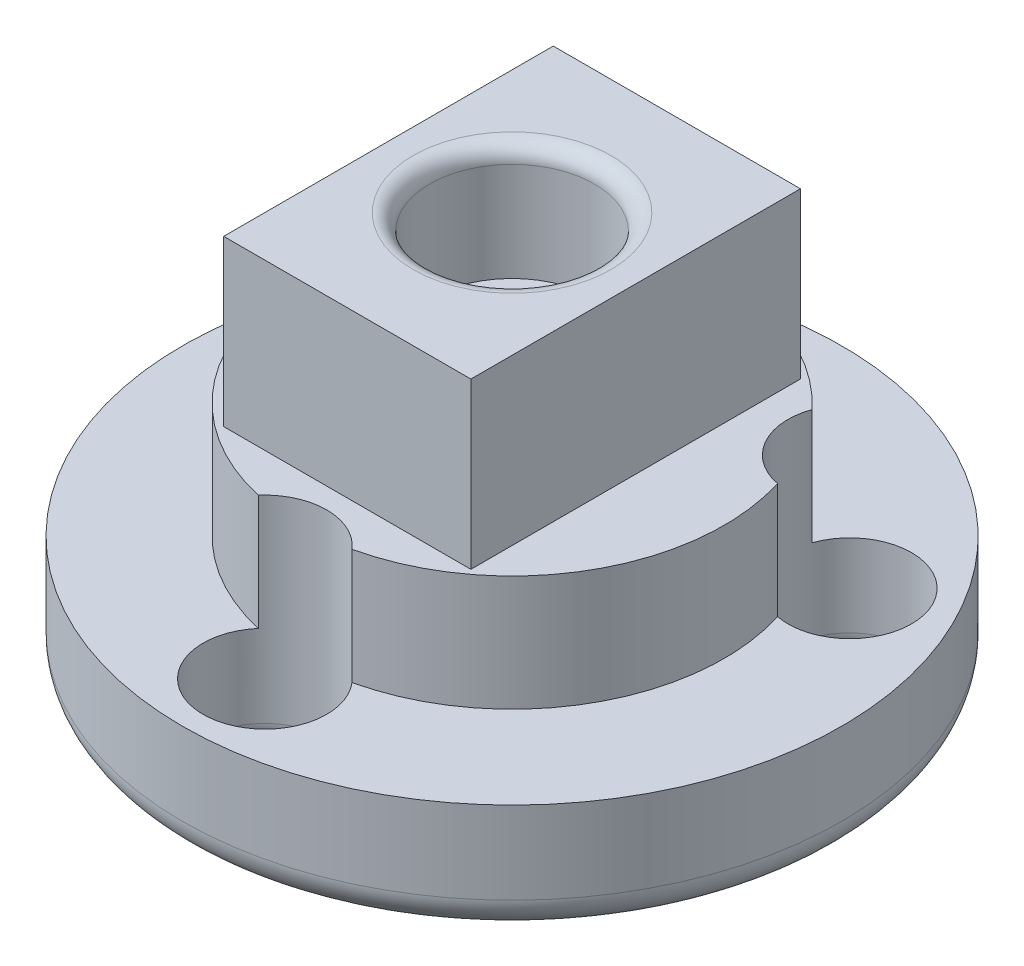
ISO-10303-21;
HEADER;
FILE_DESCRIPTION(('STEP AP214'),'2;1');
FILE_NAME('part.step','',(''),(''),'','','');
FILE_SCHEMA(('AUTOMOTIVE_DESIGN { 1 0 10303 214 1 1 1 1 }'));
ENDSEC;
DATA;
#1=APPLICATION_CONTEXT('core data for automotive mechanical design processes');
#2=APPLICATION_PROTOCOL_DEFINITION('international standard','automotive_design',2000,#1);
#3=PRODUCT_CONTEXT('',#1,'mechanical');
#4=PRODUCT('Part','Part','',(#3));
#5=PRODUCT_RELATED_PRODUCT_CATEGORY('part','',(#4));
#6=PRODUCT_DEFINITION_FORMATION('','',#4);
#7=PRODUCT_DEFINITION_CONTEXT('part definition',#1,'design');
#8=PRODUCT_DEFINITION('design','',#6,#7);
#9=PRODUCT_DEFINITION_SHAPE('','',#8);
#10=(LENGTH_UNIT() NAMED_UNIT(*) SI_UNIT(.MILLI.,.METRE.));
#11=(NAMED_UNIT(*) PLANE_ANGLE_UNIT() SI_UNIT($,.RADIAN.));
#12=(NAMED_UNIT(*) SI_UNIT($,.STERADIAN.) SOLID_ANGLE_UNIT());
#13=UNCERTAINTY_MEASURE_WITH_UNIT(LENGTH_MEASURE(1.E-05),#10,'distance_accuracy_value','');
#14=(GEOMETRIC_REPRESENTATION_CONTEXT(3) GLOBAL_UNCERTAINTY_ASSIGNED_CONTEXT((#13)) GLOBAL_UNIT_ASSIGNED_CONTEXT((#10,
#11,#12)) REPRESENTATION_CONTEXT('',''));
#15=CARTESIAN_POINT('',(0.,0.,0.));
#16=DIRECTION('',(0.,0.,1.));
#17=DIRECTION('',(1.,0.,0.));
#18=AXIS2_PLACEMENT_3D('',#15,#16,#17);
#19=CARTESIAN_POINT('',(0.,14.,0.));
#20=DIRECTION('',(0.,-1.,0.));
#21=DIRECTION('',(0.,0.,-1.));
#22=AXIS2_PLACEMENT_3D('',#19,#20,#21);
#23=CYLINDRICAL_SURFACE('',#22,12.875);
#24=CARTESIAN_POINT('',(0.,7.,0.));
#25=DIRECTION('',(0.,1.,0.));
#26=DIRECTION('',(0.,0.,1.));
#27=AXIS2_PLACEMENT_3D('',#24,#25,#26);
#28=CIRCLE('',#27,12.875);
#29=CARTESIAN_POINT('',(-12.2969039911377,7.,-3.81467917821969));
#30=VERTEX_POINT('',#29);
#31=CARTESIAN_POINT('',(-2.8448429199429,7.,12.5567708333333));
#32=VERTEX_POINT('',#31);
#33=EDGE_CURVE('E235',#30,#32,#28,.T.);
#34=ORIENTED_EDGE('',*,*,#33,.T.);
#35=DIRECTION('',(0.,-1.,0.));
#36=VECTOR('',#35,1.);
#37=CARTESIAN_POINT('',(-2.84484291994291,7.,12.5567708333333));
#38=LINE('',#37,#36);
#39=CARTESIAN_POINT('',(-2.84484291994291,14.,12.5567708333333));
#40=VERTEX_POINT('',#39);
#41=EDGE_CURVE('E218',#32,#40,#38,.F.);
#42=ORIENTED_EDGE('',*,*,#41,.T.);
#43=CARTESIAN_POINT('',(0.,14.,0.));
#44=DIRECTION('',(0.,1.,0.));
#45=DIRECTION('',(0.,0.,1.));
#46=AXIS2_PLACEMENT_3D('',#43,#44,#45);
#47=CIRCLE('',#46,12.875);
#48=CARTESIAN_POINT('',(-12.2969039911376,14.,-3.8146791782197));
#49=VERTEX_POINT('',#48);
#50=EDGE_CURVE('E222',#49,#40,#47,.T.);
#51=ORIENTED_EDGE('',*,*,#50,.F.);
#52=DIRECTION('',(0.,-1.,0.));
#53=VECTOR('',#52,1.);
#54=CARTESIAN_POINT('',(-12.2969039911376,7.,-3.81467917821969));
#55=LINE('',#54,#53);
#56=EDGE_CURVE('E188',#49,#30,#55,.T.);
#57=ORIENTED_EDGE('',*,*,#56,.T.);
#58=EDGE_LOOP('',(#34,#42,#51,#57));
#59=FACE_BOUND('',#58,.T.);
#60=ADVANCED_FACE('F44',(#59),#23,.T.);
#61=CARTESIAN_POINT('',(2.8448429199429,14.,12.5567708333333));
#62=VERTEX_POINT('',#61);
#63=CARTESIAN_POINT('',(12.2969039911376,14.,-3.81467917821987));
#64=VERTEX_POINT('',#63);
#65=EDGE_CURVE('E223',#62,#64,#47,.T.);
#66=ORIENTED_EDGE('',*,*,#65,.F.);
#67=DIRECTION('',(0.,-1.,0.));
#68=VECTOR('',#67,1.);
#69=CARTESIAN_POINT('',(2.84484291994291,7.,12.5567708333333));
#70=LINE('',#69,#68);
#71=CARTESIAN_POINT('',(2.84484291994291,7.,12.5567708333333));
#72=VERTEX_POINT('',#71);
#73=EDGE_CURVE('E211',#62,#72,#70,.T.);
#74=ORIENTED_EDGE('',*,*,#73,.T.);
#75=CARTESIAN_POINT('',(12.2969039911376,7.,-3.81467917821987));
#76=VERTEX_POINT('',#75);
#77=EDGE_CURVE('E229',#72,#76,#28,.T.);
#78=ORIENTED_EDGE('',*,*,#77,.T.);
#79=DIRECTION('',(0.,-1.,0.));
#80=VECTOR('',#79,1.);
#81=CARTESIAN_POINT('',(12.2969039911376,7.,-3.81467917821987));
#82=LINE('',#81,#80);
#83=EDGE_CURVE('E207',#76,#64,#82,.F.);
#84=ORIENTED_EDGE('',*,*,#83,.T.);
#85=EDGE_LOOP('',(#66,#74,#78,#84));
#86=FACE_BOUND('',#85,.T.);
#87=ADVANCED_FACE('F320',(#86),#23,.T.);
#88=CARTESIAN_POINT('',(0.,7.,0.));
#89=DIRECTION('',(0.,-1.,0.));
#90=DIRECTION('',(0.,0.,-1.));
#91=AXIS2_PLACEMENT_3D('',#88,#89,#90);
#92=CYLINDRICAL_SURFACE('',#91,20.);
#93=CARTESIAN_POINT('',(0.,2.,0.));
#94=DIRECTION('',(0.,1.,0.));
#95=DIRECTION('',(0.,0.,1.));
#96=AXIS2_PLACEMENT_3D('',#93,#94,#95);
#97=CIRCLE('',#96,20.);
#98=CARTESIAN_POINT('',(0.,2.,20.));
#99=VERTEX_POINT('',#98);
#100=EDGE_CURVE('E11',#99,#99,#97,.T.);
#101=ORIENTED_EDGE('',*,*,#100,.T.);
#102=EDGE_LOOP('',(#101));
#103=FACE_BOUND('',#102,.T.);
#104=CARTESIAN_POINT('',(0.,7.,0.));
#105=DIRECTION('',(0.,1.,0.));
#106=DIRECTION('',(0.,0.,1.));
#107=AXIS2_PLACEMENT_3D('',#104,#105,#106);
#108=CIRCLE('',#107,20.);
#109=CARTESIAN_POINT('',(0.,7.,20.));
#110=VERTEX_POINT('',#109);
#111=EDGE_CURVE('E227',#110,#110,#108,.T.);
#112=ORIENTED_EDGE('',*,*,#111,.F.);
#113=EDGE_LOOP('',(#112));
#114=FACE_BOUND('',#113,.T.);
#115=ADVANCED_FACE('F327',(#103,#114),#92,.T.);
#116=CARTESIAN_POINT('',(0.,7.,0.));
#117=DIRECTION('',(0.,1.,0.));
#118=DIRECTION('',(0.,0.,1.));
#119=AXIS2_PLACEMENT_3D('',#116,#117,#118);
#120=PLANE('',#119);
#121=CARTESIAN_POINT('',(0.,7.,15.));
#122=DIRECTION('',(0.,1.,0.));
#123=DIRECTION('',(0.,0.,1.));
#124=AXIS2_PLACEMENT_3D('',#121,#122,#123);
#125=CIRCLE('',#124,3.75);
#126=EDGE_CURVE('E215',#32,#72,#125,.T.);
#127=ORIENTED_EDGE('',*,*,#126,.F.);
#128=ORIENTED_EDGE('',*,*,#33,.F.);
#129=CARTESIAN_POINT('',(-12.9903810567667,7.,-7.49999999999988));
#130=DIRECTION('',(0.,1.,0.));
#131=DIRECTION('',(0.,0.,1.));
#132=AXIS2_PLACEMENT_3D('',#129,#130,#131);
#133=CIRCLE('',#132,3.75);
#134=CARTESIAN_POINT('',(-9.4520610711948,7.,-8.74209165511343));
#135=VERTEX_POINT('',#134);
#136=EDGE_CURVE('E193',#135,#30,#133,.T.);
#137=ORIENTED_EDGE('',*,*,#136,.F.);
#138=CARTESIAN_POINT('',(9.45206107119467,7.,-8.74209165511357));
#139=VERTEX_POINT('',#138);
#140=EDGE_CURVE('E234',#139,#135,#28,.T.);
#141=ORIENTED_EDGE('',*,*,#140,.F.);
#142=CARTESIAN_POINT('',(12.9903810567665,7.,-7.50000000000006));
#143=DIRECTION('',(0.,1.,0.));
#144=DIRECTION('',(0.,0.,1.));
#145=AXIS2_PLACEMENT_3D('',#142,#143,#144);
#146=CIRCLE('',#145,3.75);
#147=EDGE_CURVE('E204',#76,#139,#146,.T.);
#148=ORIENTED_EDGE('',*,*,#147,.F.);
#149=ORIENTED_EDGE('',*,*,#77,.F.);
#150=EDGE_LOOP('',(#127,#128,#137,#141,#148,#149));
#151=FACE_BOUND('',#150,.T.);
#152=ORIENTED_EDGE('',*,*,#111,.T.);
#153=EDGE_LOOP('',(#152));
#154=FACE_BOUND('',#153,.T.);
#155=ADVANCED_FACE('F342',(#151,#154),#120,.T.);
#156=CARTESIAN_POINT('',(0.,0.,0.));
#157=DIRECTION('',(0.,1.,0.));
#158=DIRECTION('',(0.,0.,1.));
#159=AXIS2_PLACEMENT_3D('',#156,#157,#158);
#160=PLANE('',#159);
#161=CARTESIAN_POINT('',(0.,0.,0.));
#162=DIRECTION('',(0.,-1.,0.));
#163=DIRECTION('',(0.,0.,-1.));
#164=AXIS2_PLACEMENT_3D('',#161,#162,#163);
#165=CIRCLE('',#164,5.);
#166=CARTESIAN_POINT('',(0.,0.,-5.));
#167=VERTEX_POINT('',#166);
#168=EDGE_CURVE('E412',#167,#167,#165,.T.);
#169=ORIENTED_EDGE('',*,*,#168,.F.);
#170=EDGE_LOOP('',(#169));
#171=FACE_BOUND('',#170,.T.);
#172=CARTESIAN_POINT('',(0.,0.,0.));
#173=DIRECTION('',(0.,1.,0.));
#174=DIRECTION('',(0.,0.,1.));
#175=AXIS2_PLACEMENT_3D('',#172,#173,#174);
#176=CIRCLE('',#175,18.);
#177=CARTESIAN_POINT('',(17.5505065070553,0.,-3.99746436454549));
#178=VERTEX_POINT('',#177);
#179=CARTESIAN_POINT('',(5.3133475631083,0.,17.1979166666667));
#180=VERTEX_POINT('',#179);
#181=EDGE_CURVE('E66',#178,#180,#176,.F.);
#182=ORIENTED_EDGE('',*,*,#181,.T.);
#183=CARTESIAN_POINT('',(0.,0.,15.));
#184=DIRECTION('',(0.,1.,0.));
#185=DIRECTION('',(0.,0.,1.));
#186=AXIS2_PLACEMENT_3D('',#183,#184,#185);
#187=CIRCLE('',#186,5.75);
#188=CARTESIAN_POINT('',(-5.3133475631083,0.,17.1979166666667));
#189=VERTEX_POINT('',#188);
#190=EDGE_CURVE('E267',#180,#189,#187,.T.);
#191=ORIENTED_EDGE('',*,*,#190,.T.);
#192=CARTESIAN_POINT('',(0.,0.,0.));
#193=DIRECTION('',(0.,1.,0.));
#194=DIRECTION('',(0.,0.,1.));
#195=AXIS2_PLACEMENT_3D('',#192,#193,#194);
#196=CIRCLE('',#195,18.);
#197=CARTESIAN_POINT('',(-17.5505065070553,0.,-3.99746436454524));
#198=VERTEX_POINT('',#197);
#199=EDGE_CURVE('E262',#189,#198,#196,.F.);
#200=ORIENTED_EDGE('',*,*,#199,.T.);
#201=CARTESIAN_POINT('',(-12.9903810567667,0.,-7.49999999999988));
#202=DIRECTION('',(0.,1.,0.));
#203=DIRECTION('',(0.,0.,1.));
#204=AXIS2_PLACEMENT_3D('',#201,#202,#203);
#205=CIRCLE('',#204,5.75);
#206=CARTESIAN_POINT('',(-12.2371589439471,0.,-13.2004523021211));
#207=VERTEX_POINT('',#206);
#208=EDGE_CURVE('E259',#198,#207,#205,.T.);
#209=ORIENTED_EDGE('',*,*,#208,.T.);
#210=CARTESIAN_POINT('',(0.,0.,0.));
#211=DIRECTION('',(0.,1.,0.));
#212=DIRECTION('',(0.,0.,1.));
#213=AXIS2_PLACEMENT_3D('',#210,#211,#212);
#214=CIRCLE('',#213,18.);
#215=CARTESIAN_POINT('',(12.2371589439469,0.,-13.2004523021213));
#216=VERTEX_POINT('',#215);
#217=EDGE_CURVE('E253',#207,#216,#214,.F.);
#218=ORIENTED_EDGE('',*,*,#217,.T.);
#219=CARTESIAN_POINT('',(12.9903810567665,0.,-7.50000000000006));
#220=DIRECTION('',(0.,1.,0.));
#221=DIRECTION('',(0.,0.,1.));
#222=AXIS2_PLACEMENT_3D('',#219,#220,#221);
#223=CIRCLE('',#222,5.75);
#224=EDGE_CURVE('E256',#216,#178,#223,.T.);
#225=ORIENTED_EDGE('',*,*,#224,.T.);
#226=EDGE_LOOP('',(#182,#191,#200,#209,#218,#225));
#227=FACE_BOUND('',#226,.T.);
#228=ADVANCED_FACE('F334',(#171,#227),#160,.F.);
#229=CARTESIAN_POINT('',(9.45206107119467,14.,-8.74209165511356));
#230=VERTEX_POINT('',#229);
#231=CARTESIAN_POINT('',(-9.45206107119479,14.,-8.74209165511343));
#232=VERTEX_POINT('',#231);
#233=EDGE_CURVE('E228',#230,#232,#47,.T.);
#234=ORIENTED_EDGE('',*,*,#233,.F.);
#235=DIRECTION('',(0.,-1.,0.));
#236=VECTOR('',#235,1.);
#237=CARTESIAN_POINT('',(9.45206107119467,7.,-8.74209165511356));
#238=LINE('',#237,#236);
#239=EDGE_CURVE('E200',#230,#139,#238,.T.);
#240=ORIENTED_EDGE('',*,*,#239,.T.);
#241=ORIENTED_EDGE('',*,*,#140,.T.);
#242=DIRECTION('',(0.,-1.,0.));
#243=VECTOR('',#242,1.);
#244=CARTESIAN_POINT('',(-9.45206107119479,7.,-8.74209165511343));
#245=LINE('',#244,#243);
#246=EDGE_CURVE('E196',#135,#232,#245,.F.);
#247=ORIENTED_EDGE('',*,*,#246,.T.);
#248=EDGE_LOOP('',(#234,#240,#241,#247));
#249=FACE_BOUND('',#248,.T.);
#250=ADVANCED_FACE('F323',(#249),#23,.T.);
#251=CARTESIAN_POINT('',(0.,14.,0.));
#252=DIRECTION('',(0.,1.,0.));
#253=DIRECTION('',(0.,0.,1.));
#254=AXIS2_PLACEMENT_3D('',#251,#252,#253);
#255=PLANE('',#254);
#256=DIRECTION('',(0.,0.,1.));
#257=VECTOR('',#256,1.);
#258=CARTESIAN_POINT('',(-7.5,14.,-10.));
#259=LINE('',#258,#257);
#260=CARTESIAN_POINT('',(-7.5,14.,-10.));
#261=VERTEX_POINT('',#260);
#262=CARTESIAN_POINT('',(-7.5,14.,10.));
#263=VERTEX_POINT('',#262);
#264=EDGE_CURVE('E173',#261,#263,#259,.T.);
#265=ORIENTED_EDGE('',*,*,#264,.F.);
#266=DIRECTION('',(-1.,0.,0.));
#267=VECTOR('',#266,1.);
#268=CARTESIAN_POINT('',(-7.5,14.,-10.));
#269=LINE('',#268,#267);
#270=CARTESIAN_POINT('',(7.5,14.,-10.));
#271=VERTEX_POINT('',#270);
#272=EDGE_CURVE('E170',#271,#261,#269,.T.);
#273=ORIENTED_EDGE('',*,*,#272,.F.);
#274=DIRECTION('',(0.,0.,-1.));
#275=VECTOR('',#274,1.);
#276=CARTESIAN_POINT('',(7.5,14.,-10.));
#277=LINE('',#276,#275);
#278=CARTESIAN_POINT('',(7.5,14.,10.));
#279=VERTEX_POINT('',#278);
#280=EDGE_CURVE('E432',#279,#271,#277,.T.);
#281=ORIENTED_EDGE('',*,*,#280,.F.);
#282=DIRECTION('',(1.,0.,0.));
#283=VECTOR('',#282,1.);
#284=CARTESIAN_POINT('',(-7.5,14.,10.));
#285=LINE('',#284,#283);
#286=EDGE_CURVE('E429',#263,#279,#285,.T.);
#287=ORIENTED_EDGE('',*,*,#286,.F.);
#288=EDGE_LOOP('',(#265,#273,#281,#287));
#289=FACE_BOUND('',#288,.T.);
#290=CARTESIAN_POINT('',(0.,14.,15.));
#291=DIRECTION('',(0.,1.,0.));
#292=DIRECTION('',(0.,0.,1.));
#293=AXIS2_PLACEMENT_3D('',#290,#291,#292);
#294=CIRCLE('',#293,3.75);
#295=EDGE_CURVE('E233',#62,#40,#294,.T.);
#296=ORIENTED_EDGE('',*,*,#295,.F.);
#297=ORIENTED_EDGE('',*,*,#65,.T.);
#298=CARTESIAN_POINT('',(12.9903810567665,14.,-7.50000000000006));
#299=DIRECTION('',(0.,-1.,0.));
#300=DIRECTION('',(0.,0.,-1.));
#301=AXIS2_PLACEMENT_3D('',#298,#299,#300);
#302=CIRCLE('',#301,3.75);
#303=EDGE_CURVE('E180',#64,#230,#302,.T.);
#304=ORIENTED_EDGE('',*,*,#303,.T.);
#305=ORIENTED_EDGE('',*,*,#233,.T.);
#306=CARTESIAN_POINT('',(-12.9903810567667,14.,-7.49999999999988));
#307=DIRECTION('',(0.,-1.,0.));
#308=DIRECTION('',(0.,0.,-1.));
#309=AXIS2_PLACEMENT_3D('',#306,#307,#308);
#310=CIRCLE('',#309,3.75);
#311=EDGE_CURVE('E175',#232,#49,#310,.T.);
#312=ORIENTED_EDGE('',*,*,#311,.T.);
#313=ORIENTED_EDGE('',*,*,#50,.T.);
#314=EDGE_LOOP('',(#296,#297,#304,#305,#312,#313));
#315=FACE_BOUND('',#314,.T.);
#316=ADVANCED_FACE('F333',(#289,#315),#255,.T.);
#317=CARTESIAN_POINT('',(-12.9903810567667,14.,-7.49999999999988));
#318=DIRECTION('',(0.,-1.,0.));
#319=DIRECTION('',(0.,0.,-1.));
#320=AXIS2_PLACEMENT_3D('',#317,#318,#319);
#321=CYLINDRICAL_SURFACE('',#320,3.75);
#322=CARTESIAN_POINT('',(-12.9903810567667,2.,-7.49999999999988));
#323=DIRECTION('',(0.,1.,0.));
#324=DIRECTION('',(0.,0.,1.));
#325=AXIS2_PLACEMENT_3D('',#322,#323,#324);
#326=CIRCLE('',#325,3.75);
#327=CARTESIAN_POINT('',(-12.9903810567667,2.,-3.74999999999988));
#328=VERTEX_POINT('',#327);
#329=EDGE_CURVE('E270',#328,#328,#326,.F.);
#330=ORIENTED_EDGE('',*,*,#329,.T.);
#331=EDGE_LOOP('',(#330));
#332=FACE_BOUND('',#331,.T.);
#333=ORIENTED_EDGE('',*,*,#136,.T.);
#334=ORIENTED_EDGE('',*,*,#56,.F.);
#335=ORIENTED_EDGE('',*,*,#311,.F.);
#336=ORIENTED_EDGE('',*,*,#246,.F.);
#337=EDGE_LOOP('',(#333,#334,#335,#336));
#338=FACE_BOUND('',#337,.T.);
#339=ADVANCED_FACE('F340',(#332,#338),#321,.F.);
#340=CARTESIAN_POINT('',(12.9903810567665,14.,-7.50000000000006));
#341=DIRECTION('',(0.,-1.,0.));
#342=DIRECTION('',(0.,0.,-1.));
#343=AXIS2_PLACEMENT_3D('',#340,#341,#342);
#344=CYLINDRICAL_SURFACE('',#343,3.75);
#345=CARTESIAN_POINT('',(12.9903810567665,2.,-7.50000000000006));
#346=DIRECTION('',(0.,1.,0.));
#347=DIRECTION('',(0.,0.,1.));
#348=AXIS2_PLACEMENT_3D('',#345,#346,#347);
#349=CIRCLE('',#348,3.75);
#350=CARTESIAN_POINT('',(12.9903810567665,2.,-3.75000000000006));
#351=VERTEX_POINT('',#350);
#352=EDGE_CURVE('E58',#351,#351,#349,.F.);
#353=ORIENTED_EDGE('',*,*,#352,.T.);
#354=EDGE_LOOP('',(#353));
#355=FACE_BOUND('',#354,.T.);
#356=ORIENTED_EDGE('',*,*,#147,.T.);
#357=ORIENTED_EDGE('',*,*,#239,.F.);
#358=ORIENTED_EDGE('',*,*,#303,.F.);
#359=ORIENTED_EDGE('',*,*,#83,.F.);
#360=EDGE_LOOP('',(#356,#357,#358,#359));
#361=FACE_BOUND('',#360,.T.);
#362=ADVANCED_FACE('F366',(#355,#361),#344,.F.);
#363=CARTESIAN_POINT('',(0.,14.,15.));
#364=DIRECTION('',(0.,-1.,0.));
#365=DIRECTION('',(0.,0.,-1.));
#366=AXIS2_PLACEMENT_3D('',#363,#364,#365);
#367=CYLINDRICAL_SURFACE('',#366,3.75);
#368=CARTESIAN_POINT('',(0.,2.,15.));
#369=DIRECTION('',(0.,1.,0.));
#370=DIRECTION('',(0.,0.,1.));
#371=AXIS2_PLACEMENT_3D('',#368,#369,#370);
#372=CIRCLE('',#371,3.75);
#373=CARTESIAN_POINT('',(0.,2.,18.75));
#374=VERTEX_POINT('',#373);
#375=EDGE_CURVE('E249',#374,#374,#372,.F.);
#376=ORIENTED_EDGE('',*,*,#375,.T.);
#377=EDGE_LOOP('',(#376));
#378=FACE_BOUND('',#377,.T.);
#379=ORIENTED_EDGE('',*,*,#126,.T.);
#380=ORIENTED_EDGE('',*,*,#73,.F.);
#381=ORIENTED_EDGE('',*,*,#295,.T.);
#382=ORIENTED_EDGE('',*,*,#41,.F.);
#383=EDGE_LOOP('',(#379,#380,#381,#382));
#384=FACE_BOUND('',#383,.T.);
#385=ADVANCED_FACE('F359',(#378,#384),#367,.F.);
#386=CARTESIAN_POINT('',(-7.5,24.,-10.));
#387=DIRECTION('',(1.,0.,0.));
#388=DIRECTION('',(0.,0.,-1.));
#389=AXIS2_PLACEMENT_3D('',#386,#387,#388);
#390=PLANE('',#389);
#391=ORIENTED_EDGE('',*,*,#264,.T.);
#392=DIRECTION('',(0.,-1.,0.));
#393=VECTOR('',#392,1.);
#394=CARTESIAN_POINT('',(-7.5,24.,10.));
#395=LINE('',#394,#393);
#396=CARTESIAN_POINT('',(-7.5,24.,10.));
#397=VERTEX_POINT('',#396);
#398=EDGE_CURVE('E152',#397,#263,#395,.T.);
#399=ORIENTED_EDGE('',*,*,#398,.F.);
#400=DIRECTION('',(0.,0.,1.));
#401=VECTOR('',#400,1.);
#402=CARTESIAN_POINT('',(-7.5,24.,-10.));
#403=LINE('',#402,#401);
#404=CARTESIAN_POINT('',(-7.5,24.,-10.));
#405=VERTEX_POINT('',#404);
#406=EDGE_CURVE('E160',#405,#397,#403,.T.);
#407=ORIENTED_EDGE('',*,*,#406,.F.);
#408=DIRECTION('',(0.,-1.,0.));
#409=VECTOR('',#408,1.);
#410=CARTESIAN_POINT('',(-7.5,24.,-10.));
#411=LINE('',#410,#409);
#412=EDGE_CURVE('E426',#405,#261,#411,.T.);
#413=ORIENTED_EDGE('',*,*,#412,.T.);
#414=EDGE_LOOP('',(#391,#399,#407,#413));
#415=FACE_BOUND('',#414,.T.);
#416=ADVANCED_FACE('F172',(#415),#390,.F.);
#417=CARTESIAN_POINT('',(-7.5,24.,10.));
#418=DIRECTION('',(0.,0.,-1.));
#419=DIRECTION('',(-1.,0.,0.));
#420=AXIS2_PLACEMENT_3D('',#417,#418,#419);
#421=PLANE('',#420);
#422=ORIENTED_EDGE('',*,*,#286,.T.);
#423=DIRECTION('',(0.,-1.,0.));
#424=VECTOR('',#423,1.);
#425=CARTESIAN_POINT('',(7.5,24.,10.));
#426=LINE('',#425,#424);
#427=CARTESIAN_POINT('',(7.5,24.,10.));
#428=VERTEX_POINT('',#427);
#429=EDGE_CURVE('E155',#428,#279,#426,.T.);
#430=ORIENTED_EDGE('',*,*,#429,.F.);
#431=DIRECTION('',(1.,0.,0.));
#432=VECTOR('',#431,1.);
#433=CARTESIAN_POINT('',(-7.5,24.,10.));
#434=LINE('',#433,#432);
#435=EDGE_CURVE('E147',#397,#428,#434,.T.);
#436=ORIENTED_EDGE('',*,*,#435,.F.);
#437=ORIENTED_EDGE('',*,*,#398,.T.);
#438=EDGE_LOOP('',(#422,#430,#436,#437));
#439=FACE_BOUND('',#438,.T.);
#440=ADVANCED_FACE('F150',(#439),#421,.F.);
#441=CARTESIAN_POINT('',(7.5,24.,-10.));
#442=DIRECTION('',(-1.,0.,0.));
#443=DIRECTION('',(0.,0.,1.));
#444=AXIS2_PLACEMENT_3D('',#441,#442,#443);
#445=PLANE('',#444);
#446=ORIENTED_EDGE('',*,*,#280,.T.);
#447=DIRECTION('',(0.,-1.,0.));
#448=VECTOR('',#447,1.);
#449=CARTESIAN_POINT('',(7.5,24.,-10.));
#450=LINE('',#449,#448);
#451=CARTESIAN_POINT('',(7.5,24.,-10.));
#452=VERTEX_POINT('',#451);
#453=EDGE_CURVE('E182',#452,#271,#450,.T.);
#454=ORIENTED_EDGE('',*,*,#453,.F.);
#455=DIRECTION('',(0.,0.,-1.));
#456=VECTOR('',#455,1.);
#457=CARTESIAN_POINT('',(7.5,24.,-10.));
#458=LINE('',#457,#456);
#459=EDGE_CURVE('E159',#428,#452,#458,.T.);
#460=ORIENTED_EDGE('',*,*,#459,.F.);
#461=ORIENTED_EDGE('',*,*,#429,.T.);
#462=EDGE_LOOP('',(#446,#454,#460,#461));
#463=FACE_BOUND('',#462,.T.);
#464=ADVANCED_FACE('F383',(#463),#445,.F.);
#465=CARTESIAN_POINT('',(-7.5,24.,-10.));
#466=DIRECTION('',(0.,0.,1.));
#467=DIRECTION('',(1.,0.,0.));
#468=AXIS2_PLACEMENT_3D('',#465,#466,#467);
#469=PLANE('',#468);
#470=ORIENTED_EDGE('',*,*,#272,.T.);
#471=ORIENTED_EDGE('',*,*,#412,.F.);
#472=DIRECTION('',(-1.,0.,0.));
#473=VECTOR('',#472,1.);
#474=CARTESIAN_POINT('',(-7.5,24.,-10.));
#475=LINE('',#474,#473);
#476=EDGE_CURVE('E165',#452,#405,#475,.T.);
#477=ORIENTED_EDGE('',*,*,#476,.F.);
#478=ORIENTED_EDGE('',*,*,#453,.T.);
#479=EDGE_LOOP('',(#470,#471,#477,#478));
#480=FACE_BOUND('',#479,.T.);
#481=ADVANCED_FACE('F386',(#480),#469,.F.);
#482=CARTESIAN_POINT('',(0.,24.,0.));
#483=DIRECTION('',(0.,1.,0.));
#484=DIRECTION('',(0.,0.,1.));
#485=AXIS2_PLACEMENT_3D('',#482,#483,#484);
#486=PLANE('',#485);
#487=CARTESIAN_POINT('',(0.,24.,0.));
#488=DIRECTION('',(0.,1.,0.));
#489=DIRECTION('',(0.,0.,1.));
#490=AXIS2_PLACEMENT_3D('',#487,#488,#489);
#491=CIRCLE('',#490,6.);
#492=CARTESIAN_POINT('',(0.,24.,6.));
#493=VERTEX_POINT('',#492);
#494=EDGE_CURVE('E245',#493,#493,#491,.F.);
#495=ORIENTED_EDGE('',*,*,#494,.T.);
#496=EDGE_LOOP('',(#495));
#497=FACE_BOUND('',#496,.T.);
#498=ORIENTED_EDGE('',*,*,#406,.T.);
#499=ORIENTED_EDGE('',*,*,#435,.T.);
#500=ORIENTED_EDGE('',*,*,#459,.T.);
#501=ORIENTED_EDGE('',*,*,#476,.T.);
#502=EDGE_LOOP('',(#498,#499,#500,#501));
#503=FACE_BOUND('',#502,.T.);
#504=ADVANCED_FACE('F163',(#497,#503),#486,.T.);
#505=CARTESIAN_POINT('',(0.,17.,0.));
#506=DIRECTION('',(0.,1.,0.));
#507=DIRECTION('',(0.,0.,1.));
#508=AXIS2_PLACEMENT_3D('',#505,#506,#507);
#509=CYLINDRICAL_SURFACE('',#508,5.);
#510=CARTESIAN_POINT('',(0.,23.,0.));
#511=DIRECTION('',(0.,1.,0.));
#512=DIRECTION('',(0.,0.,1.));
#513=AXIS2_PLACEMENT_3D('',#510,#511,#512);
#514=CIRCLE('',#513,5.);
#515=CARTESIAN_POINT('',(0.,23.,5.));
#516=VERTEX_POINT('',#515);
#517=EDGE_CURVE('E241',#516,#516,#514,.T.);
#518=ORIENTED_EDGE('',*,*,#517,.T.);
#519=EDGE_LOOP('',(#518));
#520=FACE_BOUND('',#519,.T.);
#521=CARTESIAN_POINT('',(0.,17.,0.));
#522=DIRECTION('',(0.,1.,0.));
#523=DIRECTION('',(0.,0.,1.));
#524=AXIS2_PLACEMENT_3D('',#521,#522,#523);
#525=CIRCLE('',#524,5.);
#526=CARTESIAN_POINT('',(0.,17.,5.));
#527=VERTEX_POINT('',#526);
#528=EDGE_CURVE('E418',#527,#527,#525,.T.);
#529=ORIENTED_EDGE('',*,*,#528,.F.);
#530=EDGE_LOOP('',(#529));
#531=FACE_BOUND('',#530,.T.);
#532=ADVANCED_FACE('F393',(#520,#531),#509,.F.);
#533=CARTESIAN_POINT('',(0.,17.,0.));
#534=DIRECTION('',(0.,1.,0.));
#535=DIRECTION('',(0.,0.,1.));
#536=AXIS2_PLACEMENT_3D('',#533,#534,#535);
#537=PLANE('',#536);
#538=ORIENTED_EDGE('',*,*,#528,.T.);
#539=EDGE_LOOP('',(#538));
#540=FACE_BOUND('',#539,.T.);
#541=ADVANCED_FACE('F315',(#540),#537,.T.);
#542=CARTESIAN_POINT('',(0.,23.,0.));
#543=DIRECTION('',(0.,1.,0.));
#544=DIRECTION('',(0.,0.,1.));
#545=AXIS2_PLACEMENT_3D('',#542,#543,#544);
#546=TOROIDAL_SURFACE('',#545,6.,1.);
#547=ORIENTED_EDGE('',*,*,#494,.F.);
#548=EDGE_LOOP('',(#547));
#549=FACE_BOUND('',#548,.T.);
#550=ORIENTED_EDGE('',*,*,#517,.F.);
#551=EDGE_LOOP('',(#550));
#552=FACE_BOUND('',#551,.T.);
#553=ADVANCED_FACE('F310',(#549,#552),#546,.T.);
#554=CARTESIAN_POINT('',(-12.9903810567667,2.,-7.49999999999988));
#555=DIRECTION('',(0.,1.,0.));
#556=DIRECTION('',(0.,0.,1.));
#557=AXIS2_PLACEMENT_3D('',#554,#555,#556);
#558=TOROIDAL_SURFACE('',#557,5.75,2.);
#559=ORIENTED_EDGE('',*,*,#329,.F.);
#560=EDGE_LOOP('',(#559));
#561=FACE_BOUND('',#560,.T.);
#562=CARTESIAN_POINT('',(-17.5505065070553,0.,-3.99746436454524));
#563=CARTESIAN_POINT('',(-17.5512330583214,2.03152041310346E-09,-4.00078328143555));
#564=CARTESIAN_POINT('',(-17.5519578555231,1.56900906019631E-06,-4.00410260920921));
#565=CARTESIAN_POINT('',(-17.5994595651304,0.00020698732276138,-4.22219958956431));
#566=CARTESIAN_POINT('',(-17.6388881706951,0.00693803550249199,-4.43868291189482));
#567=CARTESIAN_POINT('',(-17.7020312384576,0.0306652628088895,-4.87347104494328));
#568=CARTESIAN_POINT('',(-17.7257319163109,0.0476704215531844,-5.09177728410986));
#569=CARTESIAN_POINT('',(-17.7566702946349,0.0893711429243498,-5.52973100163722));
#570=CARTESIAN_POINT('',(-17.7638403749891,0.114097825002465,-5.74938031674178));
#571=CARTESIAN_POINT('',(-17.7608477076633,0.168464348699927,-6.18795240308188));
#572=CARTESIAN_POINT('',(-17.7506841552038,0.19810441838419,-6.40687514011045));
#573=CARTESIAN_POINT('',(-17.7121315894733,0.259800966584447,-6.84625476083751));
#574=CARTESIAN_POINT('',(-17.6834635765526,0.291887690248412,-7.06668313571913));
#575=CARTESIAN_POINT('',(-17.6070636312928,0.354604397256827,-7.50448157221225));
#576=CARTESIAN_POINT('',(-17.5593291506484,0.385234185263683,-7.72185122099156));
#577=CARTESIAN_POINT('',(-17.444595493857,0.441091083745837,-8.1511388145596));
#578=CARTESIAN_POINT('',(-17.3776842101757,0.466341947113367,-8.36307693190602));
#579=CARTESIAN_POINT('',(-17.2243578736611,0.507839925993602,-8.78068105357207));
#580=CARTESIAN_POINT('',(-17.1379496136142,0.524090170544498,-8.98634921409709));
#581=CARTESIAN_POINT('',(-16.9534815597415,0.543943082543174,-9.3735698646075));
#582=CARTESIAN_POINT('',(-16.8568472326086,0.548429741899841,-9.55575494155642));
#583=CARTESIAN_POINT('',(-16.6481901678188,0.546596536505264,-9.91102781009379));
#584=CARTESIAN_POINT('',(-16.536167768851,0.540276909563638,-10.0841158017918));
#585=CARTESIAN_POINT('',(-16.2976555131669,0.517830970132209,-10.420051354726));
#586=CARTESIAN_POINT('',(-16.1711247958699,0.501676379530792,-10.582867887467));
#587=CARTESIAN_POINT('',(-15.9052178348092,0.461936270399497,-10.8966614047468));
#588=CARTESIAN_POINT('',(-15.7658390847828,0.438349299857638,-11.0476360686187));
#589=CARTESIAN_POINT('',(-15.4633747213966,0.384569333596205,-11.3492699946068));
#590=CARTESIAN_POINT('',(-15.2992813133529,0.353988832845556,-11.498846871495));
#591=CARTESIAN_POINT('',(-14.9589288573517,0.291389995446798,-11.7831214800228));
#592=CARTESIAN_POINT('',(-14.7826678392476,0.259371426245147,-11.9178167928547));
#593=CARTESIAN_POINT('',(-14.4195470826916,0.197382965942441,-12.1720387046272));
#594=CARTESIAN_POINT('',(-14.2327014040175,0.167410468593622,-12.2915847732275));
#595=CARTESIAN_POINT('',(-13.849587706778,0.112557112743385,-12.5156245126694));
#596=CARTESIAN_POINT('',(-13.6533240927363,0.0876739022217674,-12.6201251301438));
#597=CARTESIAN_POINT('',(-13.2585185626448,0.0464380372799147,-12.8113157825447));
#598=CARTESIAN_POINT('',(-13.0602073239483,0.0298591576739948,-12.8984340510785));
#599=CARTESIAN_POINT('',(-12.65759381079,0.00674917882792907,-13.0584789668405));
#600=CARTESIAN_POINT('',(-12.4533002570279,0.000204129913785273,-13.1314251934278));
#601=CARTESIAN_POINT('',(-12.2436335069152,1.56894978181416E-06,-13.1983900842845));
#602=CARTESIAN_POINT('',(-12.2403964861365,1.97100317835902E-09,-13.1994220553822));
#603=CARTESIAN_POINT('',(-12.2371589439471,0.,-13.2004523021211));
#604=B_SPLINE_CURVE_WITH_KNOTS('',3,(#562,#563,#564,#565,#566,#567,#568,#569,#570,#571,#572,
#573,#574,#575,#576,#577,#578,#579,#580,#581,#582,#583,#584,#585,#586,#587,#588,#589,#590,#591,
#592,#593,#594,#595,#596,#597,#598,#599,#600,#601,#602,#603),.UNSPECIFIED.,.F.,.F.,(4,2,2,2,2,2,
2,2,2,2,2,2,2,2,2,2,2,2,2,2,4),(0.,0.0101926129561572,0.669625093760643,1.32963475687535,
1.99233950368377,2.65507501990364,3.32804396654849,4.00110288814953,4.67112502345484,
5.3409140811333,5.95870137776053,6.5764750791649,7.19603348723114,7.81571300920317,
8.48721862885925,9.1588332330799,9.82957573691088,10.5000075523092,11.1510189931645,
11.8011245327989,11.811317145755),.UNSPECIFIED.);
#605=EDGE_CURVE('E48',#207,#198,#604,.F.);
#606=ORIENTED_EDGE('',*,*,#605,.F.);
#607=ORIENTED_EDGE('',*,*,#208,.F.);
#608=EDGE_LOOP('',(#606,#607));
#609=FACE_BOUND('',#608,.T.);
#610=ADVANCED_FACE('F305',(#561,#609),#558,.T.);
#611=CARTESIAN_POINT('',(12.9903810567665,2.,-7.50000000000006));
#612=DIRECTION('',(0.,1.,0.));
#613=DIRECTION('',(0.,0.,1.));
#614=AXIS2_PLACEMENT_3D('',#611,#612,#613);
#615=TOROIDAL_SURFACE('',#614,5.75,2.);
#616=ORIENTED_EDGE('',*,*,#352,.F.);
#617=EDGE_LOOP('',(#616));
#618=FACE_BOUND('',#617,.T.);
#619=CARTESIAN_POINT('',(12.2371589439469,0.,-13.2004523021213));
#620=CARTESIAN_POINT('',(12.24039648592,2.03152023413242E-09,-13.1994220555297));
#621=CARTESIAN_POINT('',(12.2436335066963,1.56900905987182E-06,-13.1983900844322));
#622=CARTESIAN_POINT('',(12.4562618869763,0.000206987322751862,-13.1304792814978));
#623=CARTESIAN_POINT('',(12.6634562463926,0.00693803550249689,-13.0563837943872));
#624=CARTESIAN_POINT('',(13.0715653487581,0.030665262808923,-12.8936732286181));
#625=CARTESIAN_POINT('',(13.2724744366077,0.0476704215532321,-12.8050454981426));
#626=CARTESIAN_POINT('',(13.6672226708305,0.0893711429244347,-12.6128620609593));
#627=CARTESIAN_POINT('',(13.861029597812,0.114097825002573,-12.5092468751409));
#628=CARTESIAN_POINT('',(14.2393478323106,0.16846434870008,-12.2873691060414));
#629=CARTESIAN_POINT('',(14.4238587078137,0.198104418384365,-12.1691058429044));
#630=CARTESIAN_POINT('',(14.7850963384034,0.259800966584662,-11.916028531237));
#631=CARTESIAN_POINT('',(14.9616589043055,0.291887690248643,-11.7809871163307));
#632=CARTESIAN_POINT('',(15.3026034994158,0.354604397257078,-11.4959236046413));
#633=CARTESIAN_POINT('',(15.4669838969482,0.38523418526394,-11.345899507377));
#634=CARTESIAN_POINT('',(15.781391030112,0.44109108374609,-11.0318934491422));
#635=CARTESIAN_POINT('',(15.9314791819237,0.466341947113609,-10.8679775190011));
#636=CARTESIAN_POINT('',(16.2164717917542,0.507839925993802,-10.5263909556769));
#637=CARTESIAN_POINT('',(16.3513815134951,0.524090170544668,-10.3487251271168));
#638=CARTESIAN_POINT('',(16.5944904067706,0.543943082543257,-9.99536078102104));
#639=CARTESIAN_POINT('',(16.7039501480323,0.548429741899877,-9.82058046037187));
#640=CARTESIAN_POINT('',(16.907296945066,0.546596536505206,-9.46224170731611));
#641=CARTESIAN_POINT('',(17.0011843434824,0.540276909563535,-9.27868346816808));
#642=CARTESIAN_POINT('',(17.1728569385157,0.517830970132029,-8.90415801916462));
#643=CARTESIAN_POINT('',(17.2505948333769,0.501676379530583,-8.7131709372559));
#644=CARTESIAN_POINT('',(17.3893945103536,0.461936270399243,-8.32599199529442));
#645=CARTESIAN_POINT('',(17.4504530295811,0.438349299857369,-8.12979912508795));
#646=CARTESIAN_POINT('',(17.5604434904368,0.384569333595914,-7.71704033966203));
#647=CARTESIAN_POINT('',(17.6079341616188,0.353988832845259,-7.50014284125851));
#648=CARTESIAN_POINT('',(17.683946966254,0.291389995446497,-7.06325166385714));
#649=CARTESIAN_POINT('',(17.7124660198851,0.259371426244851,-6.84325748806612));
#650=CARTESIAN_POINT('',(17.7510682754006,0.197382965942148,-6.40167473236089));
#651=CARTESIAN_POINT('',(17.7611753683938,0.16741046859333,-6.18008859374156));
#652=CARTESIAN_POINT('',(17.7636426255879,0.112557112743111,-5.7362825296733));
#653=CARTESIAN_POINT('',(17.7560110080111,0.0876739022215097,-5.51406294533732));
#654=CARTESIAN_POINT('',(17.7241842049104,0.046438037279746,-5.07655600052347));
#655=CARTESIAN_POINT('',(17.7004752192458,0.0298591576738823,-4.86125429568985));
#656=CARTESIAN_POINT('',(17.6377714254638,0.00674917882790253,-4.4325583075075));
#657=CARTESIAN_POINT('',(17.5987979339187,0.000204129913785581,-4.2191617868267));
#658=CARTESIAN_POINT('',(17.5519578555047,1.56894978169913E-06,-4.00410260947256));
#659=CARTESIAN_POINT('',(17.5512330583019,1.97100305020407E-09,-4.00078328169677));
#660=CARTESIAN_POINT('',(17.5505065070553,0.,-3.99746436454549));
#661=B_SPLINE_CURVE_WITH_KNOTS('',3,(#619,#620,#621,#622,#623,#624,#625,#626,#627,#628,#629,
#630,#631,#632,#633,#634,#635,#636,#637,#638,#639,#640,#641,#642,#643,#644,#645,#646,#647,#648,
#649,#650,#651,#652,#653,#654,#655,#656,#657,#658,#659,#660),.UNSPECIFIED.,.F.,.F.,(4,2,2,2,2,2,
2,2,2,2,2,2,2,2,2,2,2,2,2,2,4),(0.,0.0101926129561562,0.669625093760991,1.32963475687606,
1.99233950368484,2.65507501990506,3.32804396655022,4.00110288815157,4.67112502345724,
5.34091408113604,5.9587013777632,6.5764750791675,7.19603348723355,7.81571300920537,
8.48721862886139,9.15883323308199,9.8295757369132,10.5000075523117,11.1510189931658,
11.8011245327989,11.811317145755),.UNSPECIFIED.);
#662=EDGE_CURVE('E284',#178,#216,#661,.F.);
#663=ORIENTED_EDGE('',*,*,#662,.F.);
#664=ORIENTED_EDGE('',*,*,#224,.F.);
#665=EDGE_LOOP('',(#663,#664));
#666=FACE_BOUND('',#665,.T.);
#667=ADVANCED_FACE('F299',(#618,#666),#615,.T.);
#668=CARTESIAN_POINT('',(0.,2.,0.));
#669=DIRECTION('',(0.,1.,0.));
#670=DIRECTION('',(0.,0.,1.));
#671=AXIS2_PLACEMENT_3D('',#668,#669,#670);
#672=TOROIDAL_SURFACE('',#671,18.,2.);
#673=ORIENTED_EDGE('',*,*,#100,.F.);
#674=EDGE_LOOP('',(#673));
#675=FACE_BOUND('',#674,.T.);
#676=CARTESIAN_POINT('',(5.3133475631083,0.,17.1979166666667));
#677=CARTESIAN_POINT('',(5.31083657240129,2.03148894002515E-09,17.2002053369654));
#678=CARTESIAN_POINT('',(5.30832434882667,1.56900904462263E-06,17.2024926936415));
#679=CARTESIAN_POINT('',(5.14319767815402,0.000206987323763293,17.3526788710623));
#680=CARTESIAN_POINT('',(4.9754319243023,0.00693803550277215,17.4950667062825));
#681=CARTESIAN_POINT('',(4.6304658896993,0.030665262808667,17.7671442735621));
#682=CARTESIAN_POINT('',(4.45325747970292,0.0476704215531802,17.8968227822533));
#683=CARTESIAN_POINT('',(4.08944762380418,0.0893711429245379,18.1425930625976));
#684=CARTESIAN_POINT('',(3.90281077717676,0.114097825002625,18.2586271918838));
#685=CARTESIAN_POINT('',(3.52149987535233,0.168464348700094,18.4753215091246));
#686=CARTESIAN_POINT('',(3.32682544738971,0.198104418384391,18.5759809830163));
#687=CARTESIAN_POINT('',(2.92703525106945,0.2598009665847,18.7622832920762));
#688=CARTESIAN_POINT('',(2.72180467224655,0.291887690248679,18.8476702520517));
#689=CARTESIAN_POINT('',(2.30446013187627,0.354604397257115,19.0004051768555));
#690=CARTESIAN_POINT('',(2.09234525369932,0.385234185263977,19.0677507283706));
#691=CARTESIAN_POINT('',(1.66320446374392,0.441091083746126,19.183032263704));
#692=CARTESIAN_POINT('',(1.44620502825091,0.466341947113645,19.2310544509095));
#693=CARTESIAN_POINT('',(1.00788608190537,0.507839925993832,19.3070720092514));
#694=CARTESIAN_POINT('',(0.786568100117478,0.524090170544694,19.3350743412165));
#695=CARTESIAN_POINT('',(0.358991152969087,0.543943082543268,19.3689306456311));
#696=CARTESIAN_POINT('',(0.152897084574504,0.548429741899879,19.3763354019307));
#697=CARTESIAN_POINT('',(-0.259106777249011,0.546596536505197,19.3732695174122));
#698=CARTESIAN_POINT('',(-0.465016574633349,0.540276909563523,19.3627992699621));
#699=CARTESIAN_POINT('',(-0.875201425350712,0.517830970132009,19.3242093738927));
#700=CARTESIAN_POINT('',(-1.07947003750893,0.501676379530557,19.2960388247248));
#701=CARTESIAN_POINT('',(-1.48417667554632,0.461936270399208,19.222653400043));
#702=CARTESIAN_POINT('',(-1.6846139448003,0.438349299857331,19.1774351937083));
#703=CARTESIAN_POINT('',(-2.09706876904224,0.384569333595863,19.0663103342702));
#704=CARTESIAN_POINT('',(-2.30865284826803,0.353988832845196,18.9989897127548));
#705=CARTESIAN_POINT('',(-2.72501810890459,0.29138999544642,18.8463731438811));
#706=CARTESIAN_POINT('',(-2.92979818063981,0.25937142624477,18.7610742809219));
#707=CARTESIAN_POINT('',(-3.33152119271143,0.197382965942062,18.5737134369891));
#708=CARTESIAN_POINT('',(-3.52847396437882,0.16741046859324,18.47167336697));
#709=CARTESIAN_POINT('',(-3.91405491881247,0.11255711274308,18.2519070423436));
#710=CARTESIAN_POINT('',(-4.10268691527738,0.087673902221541,18.1341880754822));
#711=CARTESIAN_POINT('',(-4.46566564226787,0.0464380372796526,17.8878717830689));
#712=CARTESIAN_POINT('',(-4.64026789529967,0.0298591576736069,17.7596883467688));
#713=CARTESIAN_POINT('',(-4.9801776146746,0.00674917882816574,17.4910372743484));
#714=CARTESIAN_POINT('',(-5.14549767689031,0.000204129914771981,17.3505869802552));
#715=CARTESIAN_POINT('',(-5.3083243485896,1.56894976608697E-06,17.2024926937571));
#716=CARTESIAN_POINT('',(-5.31083657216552,1.97097155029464E-09,17.200205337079));
#717=CARTESIAN_POINT('',(-5.3133475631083,0.,17.1979166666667));
#718=B_SPLINE_CURVE_WITH_KNOTS('',3,(#676,#677,#678,#679,#680,#681,#682,#683,#684,#685,#686,
#687,#688,#689,#690,#691,#692,#693,#694,#695,#696,#697,#698,#699,#700,#701,#702,#703,#704,#705,
#706,#707,#708,#709,#710,#711,#712,#713,#714,#715,#716,#717),.UNSPECIFIED.,.F.,.F.,(4,2,2,2,2,2,
2,2,2,2,2,2,2,2,2,2,2,2,2,2,4),(0.,0.0101926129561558,0.669625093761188,1.32963475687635,
1.9923395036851,2.65507501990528,3.32804396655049,4.00110288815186,4.6711250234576,
5.34091408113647,5.95870137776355,6.57647507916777,7.19603348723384,7.8157130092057,
8.48721862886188,9.15883323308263,9.82957573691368,10.5000075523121,11.1510189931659,
11.8011245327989,11.811317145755),.UNSPECIFIED.);
#719=EDGE_CURVE('E72',#180,#189,#718,.T.);
#720=ORIENTED_EDGE('',*,*,#719,.F.);
#721=ORIENTED_EDGE('',*,*,#181,.F.);
#722=ORIENTED_EDGE('',*,*,#662,.T.);
#723=ORIENTED_EDGE('',*,*,#217,.F.);
#724=ORIENTED_EDGE('',*,*,#605,.T.);
#725=ORIENTED_EDGE('',*,*,#199,.F.);
#726=EDGE_LOOP('',(#720,#721,#722,#723,#724,#725));
#727=FACE_BOUND('',#726,.T.);
#728=ADVANCED_FACE('F294',(#675,#727),#672,.T.);
#729=CARTESIAN_POINT('',(0.,2.,15.));
#730=DIRECTION('',(0.,1.,0.));
#731=DIRECTION('',(0.,0.,1.));
#732=AXIS2_PLACEMENT_3D('',#729,#730,#731);
#733=TOROIDAL_SURFACE('',#732,5.75,2.);
#734=ORIENTED_EDGE('',*,*,#190,.F.);
#735=ORIENTED_EDGE('',*,*,#719,.T.);
#736=EDGE_LOOP('',(#734,#735));
#737=FACE_BOUND('',#736,.T.);
#738=ORIENTED_EDGE('',*,*,#375,.F.);
#739=EDGE_LOOP('',(#738));
#740=FACE_BOUND('',#739,.T.);
#741=ADVANCED_FACE('F298',(#737,#740),#733,.T.);
#742=CARTESIAN_POINT('',(0.,3.,0.));
#743=DIRECTION('',(0.,-1.,0.));
#744=DIRECTION('',(0.,0.,-1.));
#745=AXIS2_PLACEMENT_3D('',#742,#743,#744);
#746=CYLINDRICAL_SURFACE('',#745,5.);
#747=CARTESIAN_POINT('',(0.,3.,0.));
#748=DIRECTION('',(0.,-1.,0.));
#749=DIRECTION('',(0.,0.,-1.));
#750=AXIS2_PLACEMENT_3D('',#747,#748,#749);
#751=CIRCLE('',#750,5.);
#752=CARTESIAN_POINT('',(0.,3.,-5.));
#753=VERTEX_POINT('',#752);
#754=EDGE_CURVE('E285',#753,#753,#751,.T.);
#755=ORIENTED_EDGE('',*,*,#754,.F.);
#756=EDGE_LOOP('',(#755));
#757=FACE_BOUND('',#756,.T.);
#758=ORIENTED_EDGE('',*,*,#168,.T.);
#759=EDGE_LOOP('',(#758));
#760=FACE_BOUND('',#759,.T.);
#761=ADVANCED_FACE('F302',(#757,#760),#746,.F.);
#762=CARTESIAN_POINT('',(0.,3.,0.));
#763=DIRECTION('',(0.,-1.,0.));
#764=DIRECTION('',(0.,0.,-1.));
#765=AXIS2_PLACEMENT_3D('',#762,#763,#764);
#766=PLANE('',#765);
#767=ORIENTED_EDGE('',*,*,#754,.T.);
#768=EDGE_LOOP('',(#767));
#769=FACE_BOUND('',#768,.T.);
#770=ADVANCED_FACE('F403',(#769),#766,.T.);
#771=CLOSED_SHELL('',(#60,#87,#115,#155,#228,#250,#316,#339,#362,#385,#416,#440,#464,#481,#504,
#532,#541,#553,#610,#667,#728,#741,#761,#770));
#772=MANIFOLD_SOLID_BREP('B2',#771);
#773=ADVANCED_BREP_SHAPE_REPRESENTATION('',(#18,#772),#14);
#774=SHAPE_DEFINITION_REPRESENTATION(#9,#773);
ENDSEC;
END-ISO-10303-21;
